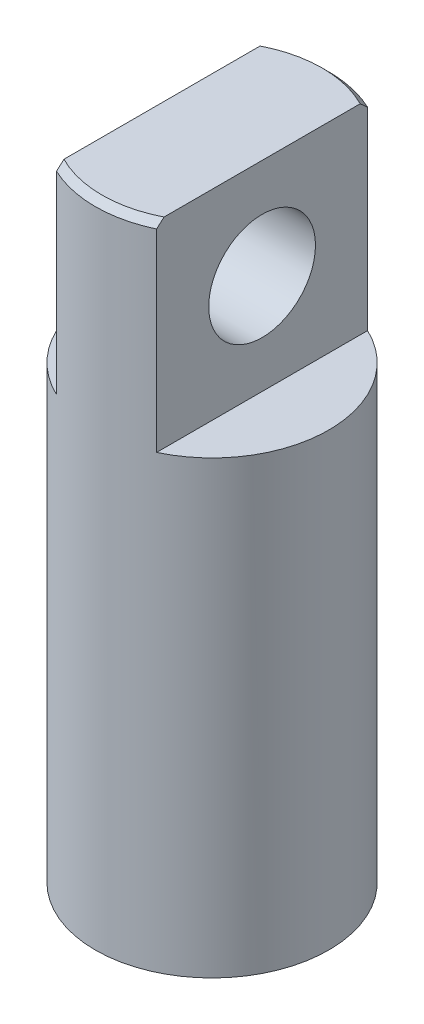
ISO-10303-21;
HEADER;
FILE_DESCRIPTION(('STEP AP214'),'2;1');
FILE_NAME('part.step','',(''),(''),'','','');
FILE_SCHEMA(('AUTOMOTIVE_DESIGN { 1 0 10303 214 1 1 1 1 }'));
ENDSEC;
DATA;
#1=APPLICATION_CONTEXT('core data for automotive mechanical design processes');
#2=APPLICATION_PROTOCOL_DEFINITION('international standard','automotive_design',2000,#1);
#3=PRODUCT_CONTEXT('',#1,'mechanical');
#4=PRODUCT('Part','Part','',(#3));
#5=PRODUCT_RELATED_PRODUCT_CATEGORY('part','',(#4));
#6=PRODUCT_DEFINITION_FORMATION('','',#4);
#7=PRODUCT_DEFINITION_CONTEXT('part definition',#1,'design');
#8=PRODUCT_DEFINITION('design','',#6,#7);
#9=PRODUCT_DEFINITION_SHAPE('','',#8);
#10=(LENGTH_UNIT() NAMED_UNIT(*) SI_UNIT(.MILLI.,.METRE.));
#11=(NAMED_UNIT(*) PLANE_ANGLE_UNIT() SI_UNIT($,.RADIAN.));
#12=(NAMED_UNIT(*) SI_UNIT($,.STERADIAN.) SOLID_ANGLE_UNIT());
#13=UNCERTAINTY_MEASURE_WITH_UNIT(LENGTH_MEASURE(1.E-05),#10,'distance_accuracy_value','');
#14=(GEOMETRIC_REPRESENTATION_CONTEXT(3) GLOBAL_UNCERTAINTY_ASSIGNED_CONTEXT((#13)) GLOBAL_UNIT_ASSIGNED_CONTEXT((#10,
#11,#12)) REPRESENTATION_CONTEXT('',''));
#15=CARTESIAN_POINT('',(0.,0.,0.));
#16=DIRECTION('',(0.,0.,1.));
#17=DIRECTION('',(1.,0.,0.));
#18=AXIS2_PLACEMENT_3D('',#15,#16,#17);
#19=CARTESIAN_POINT('',(0.,0.,0.));
#20=DIRECTION('',(0.,1.,0.));
#21=DIRECTION('',(0.,0.,1.));
#22=AXIS2_PLACEMENT_3D('',#19,#20,#21);
#23=PLANE('',#22);
#24=DIRECTION('',(0.,0.,1.));
#25=VECTOR('',#24,1.);
#26=CARTESIAN_POINT('',(-1.5,0.,3.16227766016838));
#27=LINE('',#26,#25);
#28=CARTESIAN_POINT('',(-1.5,0.,-3.16227766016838));
#29=VERTEX_POINT('',#28);
#30=CARTESIAN_POINT('',(-1.5,0.,3.16227766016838));
#31=VERTEX_POINT('',#30);
#32=EDGE_CURVE('E106',#29,#31,#27,.T.);
#33=ORIENTED_EDGE('',*,*,#32,.F.);
#34=CARTESIAN_POINT('',(0.,0.,0.));
#35=DIRECTION('',(0.,1.,0.));
#36=DIRECTION('',(0.,0.,1.));
#37=AXIS2_PLACEMENT_3D('',#34,#35,#36);
#38=CIRCLE('',#37,3.5);
#39=EDGE_CURVE('E103',#29,#31,#38,.T.);
#40=ORIENTED_EDGE('',*,*,#39,.T.);
#41=EDGE_LOOP('',(#33,#40));
#42=FACE_BOUND('',#41,.T.);
#43=ADVANCED_FACE('F34',(#42),#23,.T.);
#44=CARTESIAN_POINT('',(0.,-13.5,0.));
#45=DIRECTION('',(0.,1.,0.));
#46=DIRECTION('',(0.,0.,1.));
#47=AXIS2_PLACEMENT_3D('',#44,#45,#46);
#48=CYLINDRICAL_SURFACE('',#47,3.5);
#49=CARTESIAN_POINT('',(0.,-13.5,0.));
#50=DIRECTION('',(0.,1.,0.));
#51=DIRECTION('',(0.,0.,1.));
#52=AXIS2_PLACEMENT_3D('',#49,#50,#51);
#53=CIRCLE('',#52,3.5);
#54=CARTESIAN_POINT('',(0.,-13.5,3.5));
#55=VERTEX_POINT('',#54);
#56=EDGE_CURVE('E102',#55,#55,#53,.T.);
#57=ORIENTED_EDGE('',*,*,#56,.T.);
#58=EDGE_LOOP('',(#57));
#59=FACE_BOUND('',#58,.T.);
#60=DIRECTION('',(0.,-1.,0.));
#61=VECTOR('',#60,1.);
#62=CARTESIAN_POINT('',(-1.5,6.,-3.16227766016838));
#63=LINE('',#62,#61);
#64=CARTESIAN_POINT('',(-1.5,5.79999999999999,-3.16227766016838));
#65=VERTEX_POINT('',#64);
#66=EDGE_CURVE('E96',#65,#29,#63,.T.);
#67=ORIENTED_EDGE('',*,*,#66,.F.);
#68=CARTESIAN_POINT('',(0.,5.79999999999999,0.));
#69=DIRECTION('',(0.,1.,0.));
#70=DIRECTION('',(0.,0.,1.));
#71=AXIS2_PLACEMENT_3D('',#68,#69,#70);
#72=CIRCLE('',#71,3.5);
#73=CARTESIAN_POINT('',(1.5,5.79999999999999,-3.16227766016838));
#74=VERTEX_POINT('',#73);
#75=EDGE_CURVE('E54',#65,#74,#72,.F.);
#76=ORIENTED_EDGE('',*,*,#75,.T.);
#77=DIRECTION('',(0.,-1.,0.));
#78=VECTOR('',#77,1.);
#79=CARTESIAN_POINT('',(1.5,6.,-3.16227766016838));
#80=LINE('',#79,#78);
#81=CARTESIAN_POINT('',(1.5,0.,-3.16227766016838));
#82=VERTEX_POINT('',#81);
#83=EDGE_CURVE('E89',#74,#82,#80,.T.);
#84=ORIENTED_EDGE('',*,*,#83,.T.);
#85=CARTESIAN_POINT('',(1.5,0.,3.16227766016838));
#86=VERTEX_POINT('',#85);
#87=EDGE_CURVE('E92',#86,#82,#38,.T.);
#88=ORIENTED_EDGE('',*,*,#87,.F.);
#89=DIRECTION('',(0.,-1.,0.));
#90=VECTOR('',#89,1.);
#91=CARTESIAN_POINT('',(1.5,6.,3.16227766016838));
#92=LINE('',#91,#90);
#93=CARTESIAN_POINT('',(1.5,5.8,3.16227766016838));
#94=VERTEX_POINT('',#93);
#95=EDGE_CURVE('E95',#94,#86,#92,.T.);
#96=ORIENTED_EDGE('',*,*,#95,.F.);
#97=CARTESIAN_POINT('',(0.,5.8,0.));
#98=DIRECTION('',(0.,1.,0.));
#99=DIRECTION('',(0.,0.,1.));
#100=AXIS2_PLACEMENT_3D('',#97,#98,#99);
#101=CIRCLE('',#100,3.5);
#102=CARTESIAN_POINT('',(-1.5,5.8,3.16227766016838));
#103=VERTEX_POINT('',#102);
#104=EDGE_CURVE('E171',#94,#103,#101,.F.);
#105=ORIENTED_EDGE('',*,*,#104,.T.);
#106=DIRECTION('',(0.,-1.,0.));
#107=VECTOR('',#106,1.);
#108=CARTESIAN_POINT('',(-1.5,6.,3.16227766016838));
#109=LINE('',#108,#107);
#110=EDGE_CURVE('E135',#103,#31,#109,.T.);
#111=ORIENTED_EDGE('',*,*,#110,.T.);
#112=ORIENTED_EDGE('',*,*,#39,.F.);
#113=EDGE_LOOP('',(#67,#76,#84,#88,#96,#105,#111,#112));
#114=FACE_BOUND('',#113,.T.);
#115=ADVANCED_FACE('F91',(#59,#114),#48,.T.);
#116=CARTESIAN_POINT('',(0.,-13.5,0.));
#117=DIRECTION('',(0.,1.,0.));
#118=DIRECTION('',(0.,0.,1.));
#119=AXIS2_PLACEMENT_3D('',#116,#117,#118);
#120=PLANE('',#119);
#121=ORIENTED_EDGE('',*,*,#56,.F.);
#122=EDGE_LOOP('',(#121));
#123=FACE_BOUND('',#122,.T.);
#124=ADVANCED_FACE('F163',(#123),#120,.F.);
#125=DIRECTION('',(0.,0.,-1.));
#126=VECTOR('',#125,1.);
#127=CARTESIAN_POINT('',(1.5,0.,3.16227766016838));
#128=LINE('',#127,#126);
#129=EDGE_CURVE('E101',#86,#82,#128,.T.);
#130=ORIENTED_EDGE('',*,*,#129,.F.);
#131=ORIENTED_EDGE('',*,*,#87,.T.);
#132=EDGE_LOOP('',(#130,#131));
#133=FACE_BOUND('',#132,.T.);
#134=ADVANCED_FACE('F100',(#133),#23,.T.);
#135=CARTESIAN_POINT('',(1.5,6.,3.16227766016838));
#136=DIRECTION('',(-1.,0.,0.));
#137=DIRECTION('',(0.,0.,1.));
#138=AXIS2_PLACEMENT_3D('',#135,#136,#137);
#139=PLANE('',#138);
#140=CARTESIAN_POINT('',(1.5,3.,0.));
#141=DIRECTION('',(1.,0.,0.));
#142=DIRECTION('',(0.,0.,-1.));
#143=AXIS2_PLACEMENT_3D('',#140,#141,#142);
#144=CIRCLE('',#143,1.6);
#145=CARTESIAN_POINT('',(1.5,3.,-1.6));
#146=VERTEX_POINT('',#145);
#147=EDGE_CURVE('E113',#146,#146,#144,.T.);
#148=ORIENTED_EDGE('',*,*,#147,.F.);
#149=EDGE_LOOP('',(#148));
#150=FACE_BOUND('',#149,.T.);
#151=ORIENTED_EDGE('',*,*,#83,.F.);
#152=CARTESIAN_POINT('',(1.5,5.79999999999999,-3.16227766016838));
#153=CARTESIAN_POINT('',(1.5,5.83346476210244,-3.12524726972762));
#154=CARTESIAN_POINT('',(1.5,5.8668638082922,-3.08815791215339));
#155=CARTESIAN_POINT('',(1.5,5.93353047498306,-3.01386125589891));
#156=CARTESIAN_POINT('',(1.5,5.96679809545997,-2.97665395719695));
#157=CARTESIAN_POINT('',(1.5,6.,-2.93938769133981));
#158=B_SPLINE_CURVE_WITH_KNOTS('',3,(#152,#153,#154,#155,#156,#157),.UNSPECIFIED.,.F.,.F.,(4,2,
4),(0.,0.149733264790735,0.299466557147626),.UNSPECIFIED.);
#159=CARTESIAN_POINT('',(1.5,6.,-2.9393876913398));
#160=VERTEX_POINT('',#159);
#161=EDGE_CURVE('E11',#74,#160,#158,.T.);
#162=ORIENTED_EDGE('',*,*,#161,.T.);
#163=DIRECTION('',(0.,0.,-1.));
#164=VECTOR('',#163,1.);
#165=CARTESIAN_POINT('',(1.5,6.,3.16227766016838));
#166=LINE('',#165,#164);
#167=CARTESIAN_POINT('',(1.5,6.,2.93938769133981));
#168=VERTEX_POINT('',#167);
#169=EDGE_CURVE('E110',#168,#160,#166,.T.);
#170=ORIENTED_EDGE('',*,*,#169,.F.);
#171=CARTESIAN_POINT('',(1.5,6.,2.93938769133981));
#172=CARTESIAN_POINT('',(1.5,5.96679809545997,2.97665395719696));
#173=CARTESIAN_POINT('',(1.5,5.93353047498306,3.01386125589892));
#174=CARTESIAN_POINT('',(1.5,5.8668638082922,3.08815791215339));
#175=CARTESIAN_POINT('',(1.5,5.83346476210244,3.12524726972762));
#176=CARTESIAN_POINT('',(1.5,5.8,3.16227766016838));
#177=B_SPLINE_CURVE_WITH_KNOTS('',3,(#171,#172,#173,#174,#175,#176),.UNSPECIFIED.,.F.,.F.,(4,2,
4),(0.,0.149733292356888,0.29946655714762),.UNSPECIFIED.);
#178=EDGE_CURVE('E47',#168,#94,#177,.T.);
#179=ORIENTED_EDGE('',*,*,#178,.T.);
#180=ORIENTED_EDGE('',*,*,#95,.T.);
#181=ORIENTED_EDGE('',*,*,#129,.T.);
#182=EDGE_LOOP('',(#151,#162,#170,#179,#180,#181));
#183=FACE_BOUND('',#182,.T.);
#184=ADVANCED_FACE('F105',(#150,#183),#139,.F.);
#185=CARTESIAN_POINT('',(-1.5,6.,3.16227766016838));
#186=DIRECTION('',(1.,0.,0.));
#187=DIRECTION('',(0.,0.,-1.));
#188=AXIS2_PLACEMENT_3D('',#185,#186,#187);
#189=PLANE('',#188);
#190=CARTESIAN_POINT('',(-1.5,3.,0.));
#191=DIRECTION('',(1.,0.,0.));
#192=DIRECTION('',(0.,0.,-1.));
#193=AXIS2_PLACEMENT_3D('',#190,#191,#192);
#194=CIRCLE('',#193,1.6);
#195=CARTESIAN_POINT('',(-1.5,3.,-1.6));
#196=VERTEX_POINT('',#195);
#197=EDGE_CURVE('E107',#196,#196,#194,.F.);
#198=ORIENTED_EDGE('',*,*,#197,.F.);
#199=EDGE_LOOP('',(#198));
#200=FACE_BOUND('',#199,.T.);
#201=DIRECTION('',(0.,0.,1.));
#202=VECTOR('',#201,1.);
#203=CARTESIAN_POINT('',(-1.5,6.,3.16227766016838));
#204=LINE('',#203,#202);
#205=CARTESIAN_POINT('',(-1.5,6.,-2.93938769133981));
#206=VERTEX_POINT('',#205);
#207=CARTESIAN_POINT('',(-1.5,6.,2.93938769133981));
#208=VERTEX_POINT('',#207);
#209=EDGE_CURVE('E124',#206,#208,#204,.T.);
#210=ORIENTED_EDGE('',*,*,#209,.F.);
#211=CARTESIAN_POINT('',(-1.5,6.,-2.93938769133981));
#212=CARTESIAN_POINT('',(-1.5,5.96679809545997,-2.97665395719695));
#213=CARTESIAN_POINT('',(-1.5,5.93353047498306,-3.01386125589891));
#214=CARTESIAN_POINT('',(-1.5,5.8668638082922,-3.08815791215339));
#215=CARTESIAN_POINT('',(-1.5,5.83346476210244,-3.12524726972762));
#216=CARTESIAN_POINT('',(-1.5,5.79999999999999,-3.16227766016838));
#217=B_SPLINE_CURVE_WITH_KNOTS('',3,(#211,#212,#213,#214,#215,#216),.UNSPECIFIED.,.F.,.F.,(4,2,
4),(0.,0.149733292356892,0.299466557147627),.UNSPECIFIED.);
#218=EDGE_CURVE('E146',#206,#65,#217,.T.);
#219=ORIENTED_EDGE('',*,*,#218,.T.);
#220=ORIENTED_EDGE('',*,*,#66,.T.);
#221=ORIENTED_EDGE('',*,*,#32,.T.);
#222=ORIENTED_EDGE('',*,*,#110,.F.);
#223=CARTESIAN_POINT('',(-1.5,5.8,3.16227766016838));
#224=CARTESIAN_POINT('',(-1.5,5.83346476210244,3.12524726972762));
#225=CARTESIAN_POINT('',(-1.5,5.8668638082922,3.08815791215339));
#226=CARTESIAN_POINT('',(-1.5,5.93353047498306,3.01386125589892));
#227=CARTESIAN_POINT('',(-1.5,5.96679809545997,2.97665395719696));
#228=CARTESIAN_POINT('',(-1.5,6.,2.93938769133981));
#229=B_SPLINE_CURVE_WITH_KNOTS('',3,(#223,#224,#225,#226,#227,#228),.UNSPECIFIED.,.F.,.F.,(4,2,
4),(0.,0.149733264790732,0.29946655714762),.UNSPECIFIED.);
#230=EDGE_CURVE('E140',#103,#208,#229,.T.);
#231=ORIENTED_EDGE('',*,*,#230,.T.);
#232=EDGE_LOOP('',(#210,#219,#220,#221,#222,#231));
#233=FACE_BOUND('',#232,.T.);
#234=ADVANCED_FACE('F151',(#200,#233),#189,.F.);
#235=CARTESIAN_POINT('',(0.,6.,0.));
#236=DIRECTION('',(0.,1.,0.));
#237=DIRECTION('',(0.,0.,1.));
#238=AXIS2_PLACEMENT_3D('',#235,#236,#237);
#239=PLANE('',#238);
#240=ORIENTED_EDGE('',*,*,#169,.T.);
#241=CARTESIAN_POINT('',(0.,6.,0.));
#242=DIRECTION('',(0.,1.,0.));
#243=DIRECTION('',(0.,0.,1.));
#244=AXIS2_PLACEMENT_3D('',#241,#242,#243);
#245=CIRCLE('',#244,3.29999999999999);
#246=EDGE_CURVE('E138',#160,#206,#245,.T.);
#247=ORIENTED_EDGE('',*,*,#246,.T.);
#248=ORIENTED_EDGE('',*,*,#209,.T.);
#249=CARTESIAN_POINT('',(0.,6.,0.));
#250=DIRECTION('',(0.,1.,0.));
#251=DIRECTION('',(0.,0.,1.));
#252=AXIS2_PLACEMENT_3D('',#249,#250,#251);
#253=CIRCLE('',#252,3.3);
#254=EDGE_CURVE('E189',#208,#168,#253,.T.);
#255=ORIENTED_EDGE('',*,*,#254,.T.);
#256=EDGE_LOOP('',(#240,#247,#248,#255));
#257=FACE_BOUND('',#256,.T.);
#258=ADVANCED_FACE('F155',(#257),#239,.T.);
#259=CARTESIAN_POINT('',(-6.0254833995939,3.,0.));
#260=DIRECTION('',(1.,0.,0.));
#261=DIRECTION('',(0.,0.,-1.));
#262=AXIS2_PLACEMENT_3D('',#259,#260,#261);
#263=CYLINDRICAL_SURFACE('',#262,1.6);
#264=ORIENTED_EDGE('',*,*,#197,.T.);
#265=EDGE_LOOP('',(#264));
#266=FACE_BOUND('',#265,.T.);
#267=ORIENTED_EDGE('',*,*,#147,.T.);
#268=EDGE_LOOP('',(#267));
#269=FACE_BOUND('',#268,.T.);
#270=ADVANCED_FACE('F194',(#266,#269),#263,.F.);
#271=CARTESIAN_POINT('',(0.,6.,0.));
#272=DIRECTION('',(0.,-1.,0.));
#273=DIRECTION('',(0.,0.,-1.));
#274=AXIS2_PLACEMENT_3D('',#271,#272,#273);
#275=CONICAL_SURFACE('',#274,3.29999999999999,0.78539816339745);
#276=ORIENTED_EDGE('',*,*,#161,.F.);
#277=ORIENTED_EDGE('',*,*,#75,.F.);
#278=ORIENTED_EDGE('',*,*,#218,.F.);
#279=ORIENTED_EDGE('',*,*,#246,.F.);
#280=EDGE_LOOP('',(#276,#277,#278,#279));
#281=FACE_BOUND('',#280,.T.);
#282=ADVANCED_FACE('F181',(#281),#275,.T.);
#283=CARTESIAN_POINT('',(0.,6.,0.));
#284=DIRECTION('',(0.,-1.,0.));
#285=DIRECTION('',(0.,0.,-1.));
#286=AXIS2_PLACEMENT_3D('',#283,#284,#285);
#287=CONICAL_SURFACE('',#286,3.3,0.785398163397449);
#288=ORIENTED_EDGE('',*,*,#230,.F.);
#289=ORIENTED_EDGE('',*,*,#104,.F.);
#290=ORIENTED_EDGE('',*,*,#178,.F.);
#291=ORIENTED_EDGE('',*,*,#254,.F.);
#292=EDGE_LOOP('',(#288,#289,#290,#291));
#293=FACE_BOUND('',#292,.T.);
#294=ADVANCED_FACE('F36',(#293),#287,.T.);
#295=CLOSED_SHELL('',(#43,#115,#124,#134,#184,#234,#258,#270,#282,#294));
#296=MANIFOLD_SOLID_BREP('B2',#295);
#297=ADVANCED_BREP_SHAPE_REPRESENTATION('',(#18,#296),#14);
#298=SHAPE_DEFINITION_REPRESENTATION(#9,#297);
ENDSEC;
END-ISO-10303-21;
